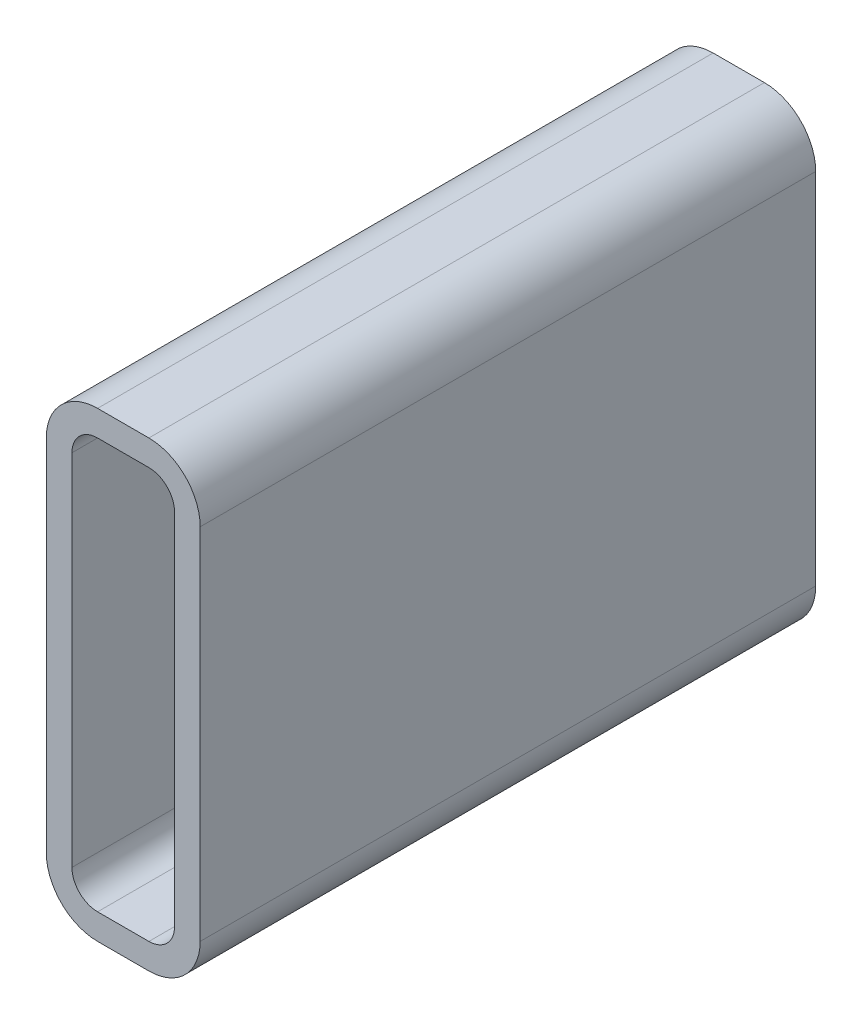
ISO-10303-21;
HEADER;
FILE_DESCRIPTION(('STEP AP214'),'2;1');
FILE_NAME('part.step','',(''),(''),'','','');
FILE_SCHEMA(('AUTOMOTIVE_DESIGN { 1 0 10303 214 1 1 1 1 }'));
ENDSEC;
DATA;
#1=APPLICATION_CONTEXT('core data for automotive mechanical design processes');
#2=APPLICATION_PROTOCOL_DEFINITION('international standard','automotive_design',2000,#1);
#3=PRODUCT_CONTEXT('',#1,'mechanical');
#4=PRODUCT('Part','Part','',(#3));
#5=PRODUCT_RELATED_PRODUCT_CATEGORY('part','',(#4));
#6=PRODUCT_DEFINITION_FORMATION('','',#4);
#7=PRODUCT_DEFINITION_CONTEXT('part definition',#1,'design');
#8=PRODUCT_DEFINITION('design','',#6,#7);
#9=PRODUCT_DEFINITION_SHAPE('','',#8);
#10=(LENGTH_UNIT() NAMED_UNIT(*) SI_UNIT(.MILLI.,.METRE.));
#11=(NAMED_UNIT(*) PLANE_ANGLE_UNIT() SI_UNIT($,.RADIAN.));
#12=(NAMED_UNIT(*) SI_UNIT($,.STERADIAN.) SOLID_ANGLE_UNIT());
#13=UNCERTAINTY_MEASURE_WITH_UNIT(LENGTH_MEASURE(1.E-05),#10,'distance_accuracy_value','');
#14=(GEOMETRIC_REPRESENTATION_CONTEXT(3) GLOBAL_UNCERTAINTY_ASSIGNED_CONTEXT((#13)) GLOBAL_UNIT_ASSIGNED_CONTEXT((#10,
#11,#12)) REPRESENTATION_CONTEXT('',''));
#15=CARTESIAN_POINT('',(0.,0.,0.));
#16=DIRECTION('',(0.,0.,1.));
#17=DIRECTION('',(1.,0.,0.));
#18=AXIS2_PLACEMENT_3D('',#15,#16,#17);
#19=CARTESIAN_POINT('',(27.8891160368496,205.143222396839,304.8));
#20=DIRECTION('',(0.,0.,1.));
#21=DIRECTION('',(1.,0.,0.));
#22=AXIS2_PLACEMENT_3D('',#19,#20,#21);
#23=PLANE('',#22);
#24=CARTESIAN_POINT('',(27.8891160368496,205.143222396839,304.8));
#25=DIRECTION('',(0.,0.,1.));
#26=DIRECTION('',(1.,0.,0.));
#27=AXIS2_PLACEMENT_3D('',#24,#25,#26);
#28=CIRCLE('',#27,25.4);
#29=CARTESIAN_POINT('',(27.8891160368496,230.543222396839,304.8));
#30=VERTEX_POINT('',#29);
#31=CARTESIAN_POINT('',(2.48911603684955,205.143222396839,304.8));
#32=VERTEX_POINT('',#31);
#33=EDGE_CURVE('E211',#30,#32,#28,.T.);
#34=ORIENTED_EDGE('',*,*,#33,.T.);
#35=DIRECTION('',(0.,-1.,0.));
#36=VECTOR('',#35,1.);
#37=CARTESIAN_POINT('',(2.48911603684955,27.3432223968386,304.8));
#38=LINE('',#37,#36);
#39=CARTESIAN_POINT('',(2.48911603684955,27.3432223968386,304.8));
#40=VERTEX_POINT('',#39);
#41=EDGE_CURVE('E214',#32,#40,#38,.T.);
#42=ORIENTED_EDGE('',*,*,#41,.T.);
#43=CARTESIAN_POINT('',(27.8891160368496,27.3432223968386,304.8));
#44=DIRECTION('',(0.,0.,1.));
#45=DIRECTION('',(1.,0.,0.));
#46=AXIS2_PLACEMENT_3D('',#43,#44,#45);
#47=CIRCLE('',#46,25.4);
#48=CARTESIAN_POINT('',(27.8891160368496,1.94322239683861,304.8));
#49=VERTEX_POINT('',#48);
#50=EDGE_CURVE('E217',#40,#49,#47,.T.);
#51=ORIENTED_EDGE('',*,*,#50,.T.);
#52=DIRECTION('',(1.,0.,0.));
#53=VECTOR('',#52,1.);
#54=CARTESIAN_POINT('',(53.2891160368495,1.94322239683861,304.8));
#55=LINE('',#54,#53);
#56=CARTESIAN_POINT('',(53.2891160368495,1.94322239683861,304.8));
#57=VERTEX_POINT('',#56);
#58=EDGE_CURVE('E219',#49,#57,#55,.T.);
#59=ORIENTED_EDGE('',*,*,#58,.T.);
#60=CARTESIAN_POINT('',(53.2891160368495,27.3432223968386,304.8));
#61=DIRECTION('',(0.,0.,1.));
#62=DIRECTION('',(1.,0.,0.));
#63=AXIS2_PLACEMENT_3D('',#60,#61,#62);
#64=CIRCLE('',#63,25.4);
#65=CARTESIAN_POINT('',(78.6891160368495,27.3432223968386,304.8));
#66=VERTEX_POINT('',#65);
#67=EDGE_CURVE('E221',#57,#66,#64,.T.);
#68=ORIENTED_EDGE('',*,*,#67,.T.);
#69=DIRECTION('',(0.,1.,0.));
#70=VECTOR('',#69,1.);
#71=CARTESIAN_POINT('',(78.6891160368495,205.143222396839,304.8));
#72=LINE('',#71,#70);
#73=CARTESIAN_POINT('',(78.6891160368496,205.143222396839,304.8));
#74=VERTEX_POINT('',#73);
#75=EDGE_CURVE('E223',#66,#74,#72,.T.);
#76=ORIENTED_EDGE('',*,*,#75,.T.);
#77=CARTESIAN_POINT('',(53.2891160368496,205.143222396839,304.8));
#78=DIRECTION('',(0.,0.,1.));
#79=DIRECTION('',(1.,0.,0.));
#80=AXIS2_PLACEMENT_3D('',#77,#78,#79);
#81=CIRCLE('',#80,25.4);
#82=CARTESIAN_POINT('',(53.2891160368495,230.543222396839,304.8));
#83=VERTEX_POINT('',#82);
#84=EDGE_CURVE('E225',#74,#83,#81,.T.);
#85=ORIENTED_EDGE('',*,*,#84,.T.);
#86=DIRECTION('',(-1.,0.,0.));
#87=VECTOR('',#86,1.);
#88=CARTESIAN_POINT('',(27.8891160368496,230.543222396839,304.8));
#89=LINE('',#88,#87);
#90=EDGE_CURVE('E227',#83,#30,#89,.T.);
#91=ORIENTED_EDGE('',*,*,#90,.T.);
#92=EDGE_LOOP('',(#34,#42,#51,#59,#68,#76,#85,#91));
#93=FACE_BOUND('',#92,.T.);
#94=DIRECTION('',(0.,-1.,0.));
#95=VECTOR('',#94,1.);
#96=CARTESIAN_POINT('',(15.1891160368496,27.3432223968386,304.8));
#97=LINE('',#96,#95);
#98=CARTESIAN_POINT('',(15.1891160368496,205.143222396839,304.8));
#99=VERTEX_POINT('',#98);
#100=CARTESIAN_POINT('',(15.1891160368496,27.3432223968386,304.8));
#101=VERTEX_POINT('',#100);
#102=EDGE_CURVE('E154',#99,#101,#97,.T.);
#103=ORIENTED_EDGE('',*,*,#102,.F.);
#104=CARTESIAN_POINT('',(27.8891160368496,205.143222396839,304.8));
#105=DIRECTION('',(0.,0.,1.));
#106=DIRECTION('',(1.,0.,0.));
#107=AXIS2_PLACEMENT_3D('',#104,#105,#106);
#108=CIRCLE('',#107,12.7);
#109=CARTESIAN_POINT('',(27.8891160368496,217.843222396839,304.8));
#110=VERTEX_POINT('',#109);
#111=EDGE_CURVE('E146',#110,#99,#108,.T.);
#112=ORIENTED_EDGE('',*,*,#111,.F.);
#113=DIRECTION('',(-1.,0.,0.));
#114=VECTOR('',#113,1.);
#115=CARTESIAN_POINT('',(27.8891160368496,217.843222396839,304.8));
#116=LINE('',#115,#114);
#117=CARTESIAN_POINT('',(53.2891160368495,217.843222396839,304.8));
#118=VERTEX_POINT('',#117);
#119=EDGE_CURVE('E179',#118,#110,#116,.T.);
#120=ORIENTED_EDGE('',*,*,#119,.F.);
#121=CARTESIAN_POINT('',(53.2891160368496,205.143222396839,304.8));
#122=DIRECTION('',(0.,0.,1.));
#123=DIRECTION('',(1.,0.,0.));
#124=AXIS2_PLACEMENT_3D('',#121,#122,#123);
#125=CIRCLE('',#124,12.7);
#126=CARTESIAN_POINT('',(65.9891160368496,205.143222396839,304.8));
#127=VERTEX_POINT('',#126);
#128=EDGE_CURVE('E177',#127,#118,#125,.T.);
#129=ORIENTED_EDGE('',*,*,#128,.F.);
#130=DIRECTION('',(0.,1.,0.));
#131=VECTOR('',#130,1.);
#132=CARTESIAN_POINT('',(65.9891160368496,205.143222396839,304.8));
#133=LINE('',#132,#131);
#134=CARTESIAN_POINT('',(65.9891160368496,27.3432223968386,304.8));
#135=VERTEX_POINT('',#134);
#136=EDGE_CURVE('E175',#135,#127,#133,.T.);
#137=ORIENTED_EDGE('',*,*,#136,.F.);
#138=CARTESIAN_POINT('',(53.2891160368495,27.3432223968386,304.8));
#139=DIRECTION('',(0.,0.,1.));
#140=DIRECTION('',(1.,0.,0.));
#141=AXIS2_PLACEMENT_3D('',#138,#139,#140);
#142=CIRCLE('',#141,12.7);
#143=CARTESIAN_POINT('',(53.2891160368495,14.6432223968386,304.8));
#144=VERTEX_POINT('',#143);
#145=EDGE_CURVE('E173',#144,#135,#142,.T.);
#146=ORIENTED_EDGE('',*,*,#145,.F.);
#147=DIRECTION('',(1.,0.,0.));
#148=VECTOR('',#147,1.);
#149=CARTESIAN_POINT('',(53.2891160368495,14.6432223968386,304.8));
#150=LINE('',#149,#148);
#151=CARTESIAN_POINT('',(27.8891160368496,14.6432223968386,304.8));
#152=VERTEX_POINT('',#151);
#153=EDGE_CURVE('E169',#152,#144,#150,.T.);
#154=ORIENTED_EDGE('',*,*,#153,.F.);
#155=CARTESIAN_POINT('',(27.8891160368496,27.3432223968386,304.8));
#156=DIRECTION('',(0.,0.,1.));
#157=DIRECTION('',(1.,0.,0.));
#158=AXIS2_PLACEMENT_3D('',#155,#156,#157);
#159=CIRCLE('',#158,12.7);
#160=EDGE_CURVE('E167',#101,#152,#159,.T.);
#161=ORIENTED_EDGE('',*,*,#160,.F.);
#162=EDGE_LOOP('',(#103,#112,#120,#129,#137,#146,#154,#161));
#163=FACE_BOUND('',#162,.T.);
#164=ADVANCED_FACE('F33',(#93,#163),#23,.T.);
#165=CARTESIAN_POINT('',(27.8891160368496,205.143222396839,0.));
#166=DIRECTION('',(0.,0.,1.));
#167=DIRECTION('',(1.,0.,0.));
#168=AXIS2_PLACEMENT_3D('',#165,#166,#167);
#169=PLANE('',#168);
#170=CARTESIAN_POINT('',(27.8891160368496,205.143222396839,0.));
#171=DIRECTION('',(0.,0.,1.));
#172=DIRECTION('',(1.,0.,0.));
#173=AXIS2_PLACEMENT_3D('',#170,#171,#172);
#174=CIRCLE('',#173,25.4);
#175=CARTESIAN_POINT('',(27.8891160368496,230.543222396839,0.));
#176=VERTEX_POINT('',#175);
#177=CARTESIAN_POINT('',(2.48911603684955,205.143222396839,0.));
#178=VERTEX_POINT('',#177);
#179=EDGE_CURVE('E162',#176,#178,#174,.T.);
#180=ORIENTED_EDGE('',*,*,#179,.F.);
#181=DIRECTION('',(-1.,0.,0.));
#182=VECTOR('',#181,1.);
#183=CARTESIAN_POINT('',(27.8891160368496,230.543222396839,0.));
#184=LINE('',#183,#182);
#185=CARTESIAN_POINT('',(53.2891160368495,230.543222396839,0.));
#186=VERTEX_POINT('',#185);
#187=EDGE_CURVE('E215',#186,#176,#184,.T.);
#188=ORIENTED_EDGE('',*,*,#187,.F.);
#189=CARTESIAN_POINT('',(53.2891160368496,205.143222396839,0.));
#190=DIRECTION('',(0.,0.,1.));
#191=DIRECTION('',(1.,0.,0.));
#192=AXIS2_PLACEMENT_3D('',#189,#190,#191);
#193=CIRCLE('',#192,25.4);
#194=CARTESIAN_POINT('',(78.6891160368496,205.143222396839,0.));
#195=VERTEX_POINT('',#194);
#196=EDGE_CURVE('E242',#195,#186,#193,.T.);
#197=ORIENTED_EDGE('',*,*,#196,.F.);
#198=DIRECTION('',(0.,1.,0.));
#199=VECTOR('',#198,1.);
#200=CARTESIAN_POINT('',(78.6891160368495,205.143222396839,0.));
#201=LINE('',#200,#199);
#202=CARTESIAN_POINT('',(78.6891160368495,27.3432223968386,0.));
#203=VERTEX_POINT('',#202);
#204=EDGE_CURVE('E240',#203,#195,#201,.T.);
#205=ORIENTED_EDGE('',*,*,#204,.F.);
#206=CARTESIAN_POINT('',(53.2891160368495,27.3432223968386,0.));
#207=DIRECTION('',(0.,0.,1.));
#208=DIRECTION('',(1.,0.,0.));
#209=AXIS2_PLACEMENT_3D('',#206,#207,#208);
#210=CIRCLE('',#209,25.4);
#211=CARTESIAN_POINT('',(53.2891160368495,1.94322239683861,0.));
#212=VERTEX_POINT('',#211);
#213=EDGE_CURVE('E238',#212,#203,#210,.T.);
#214=ORIENTED_EDGE('',*,*,#213,.F.);
#215=DIRECTION('',(1.,0.,0.));
#216=VECTOR('',#215,1.);
#217=CARTESIAN_POINT('',(53.2891160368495,1.94322239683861,0.));
#218=LINE('',#217,#216);
#219=CARTESIAN_POINT('',(27.8891160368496,1.94322239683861,0.));
#220=VERTEX_POINT('',#219);
#221=EDGE_CURVE('E236',#220,#212,#218,.T.);
#222=ORIENTED_EDGE('',*,*,#221,.F.);
#223=CARTESIAN_POINT('',(27.8891160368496,27.3432223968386,0.));
#224=DIRECTION('',(0.,0.,1.));
#225=DIRECTION('',(1.,0.,0.));
#226=AXIS2_PLACEMENT_3D('',#223,#224,#225);
#227=CIRCLE('',#226,25.4);
#228=CARTESIAN_POINT('',(2.48911603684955,27.3432223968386,0.));
#229=VERTEX_POINT('',#228);
#230=EDGE_CURVE('E234',#229,#220,#227,.T.);
#231=ORIENTED_EDGE('',*,*,#230,.F.);
#232=DIRECTION('',(0.,-1.,0.));
#233=VECTOR('',#232,1.);
#234=CARTESIAN_POINT('',(2.48911603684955,27.3432223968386,0.));
#235=LINE('',#234,#233);
#236=EDGE_CURVE('E232',#178,#229,#235,.T.);
#237=ORIENTED_EDGE('',*,*,#236,.F.);
#238=EDGE_LOOP('',(#180,#188,#197,#205,#214,#222,#231,#237));
#239=FACE_BOUND('',#238,.T.);
#240=CARTESIAN_POINT('',(27.8891160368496,205.143222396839,0.));
#241=DIRECTION('',(0.,0.,1.));
#242=DIRECTION('',(1.,0.,0.));
#243=AXIS2_PLACEMENT_3D('',#240,#241,#242);
#244=CIRCLE('',#243,12.7);
#245=CARTESIAN_POINT('',(27.8891160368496,217.843222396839,0.));
#246=VERTEX_POINT('',#245);
#247=CARTESIAN_POINT('',(15.1891160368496,205.143222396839,0.));
#248=VERTEX_POINT('',#247);
#249=EDGE_CURVE('E56',#246,#248,#244,.T.);
#250=ORIENTED_EDGE('',*,*,#249,.T.);
#251=DIRECTION('',(0.,-1.,0.));
#252=VECTOR('',#251,1.);
#253=CARTESIAN_POINT('',(15.1891160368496,27.3432223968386,0.));
#254=LINE('',#253,#252);
#255=CARTESIAN_POINT('',(15.1891160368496,27.3432223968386,0.));
#256=VERTEX_POINT('',#255);
#257=EDGE_CURVE('E161',#248,#256,#254,.T.);
#258=ORIENTED_EDGE('',*,*,#257,.T.);
#259=CARTESIAN_POINT('',(27.8891160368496,27.3432223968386,0.));
#260=DIRECTION('',(0.,0.,1.));
#261=DIRECTION('',(1.,0.,0.));
#262=AXIS2_PLACEMENT_3D('',#259,#260,#261);
#263=CIRCLE('',#262,12.7);
#264=CARTESIAN_POINT('',(27.8891160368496,14.6432223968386,0.));
#265=VERTEX_POINT('',#264);
#266=EDGE_CURVE('E183',#256,#265,#263,.T.);
#267=ORIENTED_EDGE('',*,*,#266,.T.);
#268=DIRECTION('',(1.,0.,0.));
#269=VECTOR('',#268,1.);
#270=CARTESIAN_POINT('',(53.2891160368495,14.6432223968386,0.));
#271=LINE('',#270,#269);
#272=CARTESIAN_POINT('',(53.2891160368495,14.6432223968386,0.));
#273=VERTEX_POINT('',#272);
#274=EDGE_CURVE('E186',#265,#273,#271,.T.);
#275=ORIENTED_EDGE('',*,*,#274,.T.);
#276=CARTESIAN_POINT('',(53.2891160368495,27.3432223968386,0.));
#277=DIRECTION('',(0.,0.,1.));
#278=DIRECTION('',(1.,0.,0.));
#279=AXIS2_PLACEMENT_3D('',#276,#277,#278);
#280=CIRCLE('',#279,12.7);
#281=CARTESIAN_POINT('',(65.9891160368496,27.3432223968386,0.));
#282=VERTEX_POINT('',#281);
#283=EDGE_CURVE('E189',#273,#282,#280,.T.);
#284=ORIENTED_EDGE('',*,*,#283,.T.);
#285=DIRECTION('',(0.,1.,0.));
#286=VECTOR('',#285,1.);
#287=CARTESIAN_POINT('',(65.9891160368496,205.143222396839,0.));
#288=LINE('',#287,#286);
#289=CARTESIAN_POINT('',(65.9891160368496,205.143222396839,0.));
#290=VERTEX_POINT('',#289);
#291=EDGE_CURVE('E192',#282,#290,#288,.T.);
#292=ORIENTED_EDGE('',*,*,#291,.T.);
#293=CARTESIAN_POINT('',(53.2891160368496,205.143222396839,0.));
#294=DIRECTION('',(0.,0.,1.));
#295=DIRECTION('',(1.,0.,0.));
#296=AXIS2_PLACEMENT_3D('',#293,#294,#295);
#297=CIRCLE('',#296,12.7);
#298=CARTESIAN_POINT('',(53.2891160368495,217.843222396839,0.));
#299=VERTEX_POINT('',#298);
#300=EDGE_CURVE('E195',#290,#299,#297,.T.);
#301=ORIENTED_EDGE('',*,*,#300,.T.);
#302=DIRECTION('',(-1.,0.,0.));
#303=VECTOR('',#302,1.);
#304=CARTESIAN_POINT('',(27.8891160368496,217.843222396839,0.));
#305=LINE('',#304,#303);
#306=EDGE_CURVE('E155',#299,#246,#305,.T.);
#307=ORIENTED_EDGE('',*,*,#306,.T.);
#308=EDGE_LOOP('',(#250,#258,#267,#275,#284,#292,#301,#307));
#309=FACE_BOUND('',#308,.T.);
#310=ADVANCED_FACE('F272',(#239,#309),#169,.F.);
#311=CARTESIAN_POINT('',(27.8891160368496,205.143222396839,304.8));
#312=DIRECTION('',(0.,0.,-1.));
#313=DIRECTION('',(-1.,0.,0.));
#314=AXIS2_PLACEMENT_3D('',#311,#312,#313);
#315=CYLINDRICAL_SURFACE('',#314,25.4);
#316=ORIENTED_EDGE('',*,*,#179,.T.);
#317=DIRECTION('',(0.,0.,-1.));
#318=VECTOR('',#317,1.);
#319=CARTESIAN_POINT('',(2.48911603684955,205.143222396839,304.8));
#320=LINE('',#319,#318);
#321=EDGE_CURVE('E11',#32,#178,#320,.T.);
#322=ORIENTED_EDGE('',*,*,#321,.F.);
#323=ORIENTED_EDGE('',*,*,#33,.F.);
#324=DIRECTION('',(0.,0.,-1.));
#325=VECTOR('',#324,1.);
#326=CARTESIAN_POINT('',(27.8891160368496,230.543222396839,304.8));
#327=LINE('',#326,#325);
#328=EDGE_CURVE('E229',#30,#176,#327,.T.);
#329=ORIENTED_EDGE('',*,*,#328,.T.);
#330=EDGE_LOOP('',(#316,#322,#323,#329));
#331=FACE_BOUND('',#330,.T.);
#332=ADVANCED_FACE('F35',(#331),#315,.T.);
#333=CARTESIAN_POINT('',(2.48911603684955,27.3432223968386,304.8));
#334=DIRECTION('',(1.,0.,0.));
#335=DIRECTION('',(0.,0.,-1.));
#336=AXIS2_PLACEMENT_3D('',#333,#334,#335);
#337=PLANE('',#336);
#338=ORIENTED_EDGE('',*,*,#236,.T.);
#339=DIRECTION('',(0.,0.,-1.));
#340=VECTOR('',#339,1.);
#341=CARTESIAN_POINT('',(2.48911603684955,27.3432223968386,304.8));
#342=LINE('',#341,#340);
#343=EDGE_CURVE('E41',#40,#229,#342,.T.);
#344=ORIENTED_EDGE('',*,*,#343,.F.);
#345=ORIENTED_EDGE('',*,*,#41,.F.);
#346=ORIENTED_EDGE('',*,*,#321,.T.);
#347=EDGE_LOOP('',(#338,#344,#345,#346));
#348=FACE_BOUND('',#347,.T.);
#349=ADVANCED_FACE('F289',(#348),#337,.F.);
#350=CARTESIAN_POINT('',(27.8891160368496,27.3432223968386,304.8));
#351=DIRECTION('',(0.,0.,-1.));
#352=DIRECTION('',(-1.,0.,0.));
#353=AXIS2_PLACEMENT_3D('',#350,#351,#352);
#354=CYLINDRICAL_SURFACE('',#353,25.4);
#355=ORIENTED_EDGE('',*,*,#230,.T.);
#356=DIRECTION('',(0.,0.,-1.));
#357=VECTOR('',#356,1.);
#358=CARTESIAN_POINT('',(27.8891160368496,1.94322239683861,304.8));
#359=LINE('',#358,#357);
#360=EDGE_CURVE('E259',#49,#220,#359,.T.);
#361=ORIENTED_EDGE('',*,*,#360,.F.);
#362=ORIENTED_EDGE('',*,*,#50,.F.);
#363=ORIENTED_EDGE('',*,*,#343,.T.);
#364=EDGE_LOOP('',(#355,#361,#362,#363));
#365=FACE_BOUND('',#364,.T.);
#366=ADVANCED_FACE('F266',(#365),#354,.T.);
#367=CARTESIAN_POINT('',(53.2891160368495,1.94322239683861,304.8));
#368=DIRECTION('',(0.,1.,0.));
#369=DIRECTION('',(0.,0.,1.));
#370=AXIS2_PLACEMENT_3D('',#367,#368,#369);
#371=PLANE('',#370);
#372=ORIENTED_EDGE('',*,*,#221,.T.);
#373=DIRECTION('',(0.,0.,-1.));
#374=VECTOR('',#373,1.);
#375=CARTESIAN_POINT('',(53.2891160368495,1.94322239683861,304.8));
#376=LINE('',#375,#374);
#377=EDGE_CURVE('E256',#57,#212,#376,.T.);
#378=ORIENTED_EDGE('',*,*,#377,.F.);
#379=ORIENTED_EDGE('',*,*,#58,.F.);
#380=ORIENTED_EDGE('',*,*,#360,.T.);
#381=EDGE_LOOP('',(#372,#378,#379,#380));
#382=FACE_BOUND('',#381,.T.);
#383=ADVANCED_FACE('F278',(#382),#371,.F.);
#384=CARTESIAN_POINT('',(53.2891160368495,27.3432223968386,304.8));
#385=DIRECTION('',(0.,0.,-1.));
#386=DIRECTION('',(-1.,0.,0.));
#387=AXIS2_PLACEMENT_3D('',#384,#385,#386);
#388=CYLINDRICAL_SURFACE('',#387,25.4);
#389=ORIENTED_EDGE('',*,*,#213,.T.);
#390=DIRECTION('',(0.,0.,-1.));
#391=VECTOR('',#390,1.);
#392=CARTESIAN_POINT('',(78.6891160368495,27.3432223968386,304.8));
#393=LINE('',#392,#391);
#394=EDGE_CURVE('E253',#66,#203,#393,.T.);
#395=ORIENTED_EDGE('',*,*,#394,.F.);
#396=ORIENTED_EDGE('',*,*,#67,.F.);
#397=ORIENTED_EDGE('',*,*,#377,.T.);
#398=EDGE_LOOP('',(#389,#395,#396,#397));
#399=FACE_BOUND('',#398,.T.);
#400=ADVANCED_FACE('F282',(#399),#388,.T.);
#401=CARTESIAN_POINT('',(78.6891160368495,205.143222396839,304.8));
#402=DIRECTION('',(-1.,0.,0.));
#403=DIRECTION('',(0.,0.,1.));
#404=AXIS2_PLACEMENT_3D('',#401,#402,#403);
#405=PLANE('',#404);
#406=ORIENTED_EDGE('',*,*,#204,.T.);
#407=DIRECTION('',(0.,0.,-1.));
#408=VECTOR('',#407,1.);
#409=CARTESIAN_POINT('',(78.6891160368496,205.143222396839,304.8));
#410=LINE('',#409,#408);
#411=EDGE_CURVE('E250',#74,#195,#410,.T.);
#412=ORIENTED_EDGE('',*,*,#411,.F.);
#413=ORIENTED_EDGE('',*,*,#75,.F.);
#414=ORIENTED_EDGE('',*,*,#394,.T.);
#415=EDGE_LOOP('',(#406,#412,#413,#414));
#416=FACE_BOUND('',#415,.T.);
#417=ADVANCED_FACE('F302',(#416),#405,.F.);
#418=CARTESIAN_POINT('',(53.2891160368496,205.143222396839,304.8));
#419=DIRECTION('',(0.,0.,-1.));
#420=DIRECTION('',(-1.,0.,0.));
#421=AXIS2_PLACEMENT_3D('',#418,#419,#420);
#422=CYLINDRICAL_SURFACE('',#421,25.4);
#423=ORIENTED_EDGE('',*,*,#196,.T.);
#424=DIRECTION('',(0.,0.,-1.));
#425=VECTOR('',#424,1.);
#426=CARTESIAN_POINT('',(53.2891160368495,230.543222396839,304.8));
#427=LINE('',#426,#425);
#428=EDGE_CURVE('E247',#83,#186,#427,.T.);
#429=ORIENTED_EDGE('',*,*,#428,.F.);
#430=ORIENTED_EDGE('',*,*,#84,.F.);
#431=ORIENTED_EDGE('',*,*,#411,.T.);
#432=EDGE_LOOP('',(#423,#429,#430,#431));
#433=FACE_BOUND('',#432,.T.);
#434=ADVANCED_FACE('F300',(#433),#422,.T.);
#435=CARTESIAN_POINT('',(27.8891160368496,230.543222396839,304.8));
#436=DIRECTION('',(0.,-1.,0.));
#437=DIRECTION('',(0.,0.,-1.));
#438=AXIS2_PLACEMENT_3D('',#435,#436,#437);
#439=PLANE('',#438);
#440=ORIENTED_EDGE('',*,*,#187,.T.);
#441=ORIENTED_EDGE('',*,*,#328,.F.);
#442=ORIENTED_EDGE('',*,*,#90,.F.);
#443=ORIENTED_EDGE('',*,*,#428,.T.);
#444=EDGE_LOOP('',(#440,#441,#442,#443));
#445=FACE_BOUND('',#444,.T.);
#446=ADVANCED_FACE('F295',(#445),#439,.F.);
#447=CARTESIAN_POINT('',(27.8891160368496,205.143222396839,304.8));
#448=DIRECTION('',(0.,0.,-1.));
#449=DIRECTION('',(-1.,0.,0.));
#450=AXIS2_PLACEMENT_3D('',#447,#448,#449);
#451=CYLINDRICAL_SURFACE('',#450,12.7);
#452=ORIENTED_EDGE('',*,*,#249,.F.);
#453=DIRECTION('',(0.,0.,-1.));
#454=VECTOR('',#453,1.);
#455=CARTESIAN_POINT('',(27.8891160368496,217.843222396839,304.8));
#456=LINE('',#455,#454);
#457=EDGE_CURVE('E150',#110,#246,#456,.T.);
#458=ORIENTED_EDGE('',*,*,#457,.F.);
#459=ORIENTED_EDGE('',*,*,#111,.T.);
#460=DIRECTION('',(0.,0.,-1.));
#461=VECTOR('',#460,1.);
#462=CARTESIAN_POINT('',(15.1891160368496,205.143222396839,304.8));
#463=LINE('',#462,#461);
#464=EDGE_CURVE('E149',#99,#248,#463,.T.);
#465=ORIENTED_EDGE('',*,*,#464,.T.);
#466=EDGE_LOOP('',(#452,#458,#459,#465));
#467=FACE_BOUND('',#466,.T.);
#468=ADVANCED_FACE('F148',(#467),#451,.F.);
#469=CARTESIAN_POINT('',(15.1891160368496,27.3432223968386,304.8));
#470=DIRECTION('',(1.,0.,0.));
#471=DIRECTION('',(0.,0.,-1.));
#472=AXIS2_PLACEMENT_3D('',#469,#470,#471);
#473=PLANE('',#472);
#474=ORIENTED_EDGE('',*,*,#257,.F.);
#475=ORIENTED_EDGE('',*,*,#464,.F.);
#476=ORIENTED_EDGE('',*,*,#102,.T.);
#477=DIRECTION('',(0.,0.,-1.));
#478=VECTOR('',#477,1.);
#479=CARTESIAN_POINT('',(15.1891160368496,27.3432223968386,304.8));
#480=LINE('',#479,#478);
#481=EDGE_CURVE('E163',#101,#256,#480,.T.);
#482=ORIENTED_EDGE('',*,*,#481,.T.);
#483=EDGE_LOOP('',(#474,#475,#476,#482));
#484=FACE_BOUND('',#483,.T.);
#485=ADVANCED_FACE('F158',(#484),#473,.T.);
#486=CARTESIAN_POINT('',(27.8891160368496,27.3432223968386,304.8));
#487=DIRECTION('',(0.,0.,-1.));
#488=DIRECTION('',(-1.,0.,0.));
#489=AXIS2_PLACEMENT_3D('',#486,#487,#488);
#490=CYLINDRICAL_SURFACE('',#489,12.7);
#491=ORIENTED_EDGE('',*,*,#266,.F.);
#492=ORIENTED_EDGE('',*,*,#481,.F.);
#493=ORIENTED_EDGE('',*,*,#160,.T.);
#494=DIRECTION('',(0.,0.,-1.));
#495=VECTOR('',#494,1.);
#496=CARTESIAN_POINT('',(27.8891160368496,14.6432223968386,304.8));
#497=LINE('',#496,#495);
#498=EDGE_CURVE('E208',#152,#265,#497,.T.);
#499=ORIENTED_EDGE('',*,*,#498,.T.);
#500=EDGE_LOOP('',(#491,#492,#493,#499));
#501=FACE_BOUND('',#500,.T.);
#502=ADVANCED_FACE('F327',(#501),#490,.F.);
#503=CARTESIAN_POINT('',(53.2891160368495,14.6432223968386,304.8));
#504=DIRECTION('',(0.,1.,0.));
#505=DIRECTION('',(0.,0.,1.));
#506=AXIS2_PLACEMENT_3D('',#503,#504,#505);
#507=PLANE('',#506);
#508=ORIENTED_EDGE('',*,*,#274,.F.);
#509=ORIENTED_EDGE('',*,*,#498,.F.);
#510=ORIENTED_EDGE('',*,*,#153,.T.);
#511=DIRECTION('',(0.,0.,-1.));
#512=VECTOR('',#511,1.);
#513=CARTESIAN_POINT('',(53.2891160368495,14.6432223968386,304.8));
#514=LINE('',#513,#512);
#515=EDGE_CURVE('E206',#144,#273,#514,.T.);
#516=ORIENTED_EDGE('',*,*,#515,.T.);
#517=EDGE_LOOP('',(#508,#509,#510,#516));
#518=FACE_BOUND('',#517,.T.);
#519=ADVANCED_FACE('F331',(#518),#507,.T.);
#520=CARTESIAN_POINT('',(53.2891160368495,27.3432223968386,304.8));
#521=DIRECTION('',(0.,0.,-1.));
#522=DIRECTION('',(-1.,0.,0.));
#523=AXIS2_PLACEMENT_3D('',#520,#521,#522);
#524=CYLINDRICAL_SURFACE('',#523,12.7);
#525=ORIENTED_EDGE('',*,*,#283,.F.);
#526=ORIENTED_EDGE('',*,*,#515,.F.);
#527=ORIENTED_EDGE('',*,*,#145,.T.);
#528=DIRECTION('',(0.,0.,-1.));
#529=VECTOR('',#528,1.);
#530=CARTESIAN_POINT('',(65.9891160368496,27.3432223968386,304.8));
#531=LINE('',#530,#529);
#532=EDGE_CURVE('E204',#135,#282,#531,.T.);
#533=ORIENTED_EDGE('',*,*,#532,.T.);
#534=EDGE_LOOP('',(#525,#526,#527,#533));
#535=FACE_BOUND('',#534,.T.);
#536=ADVANCED_FACE('F337',(#535),#524,.F.);
#537=CARTESIAN_POINT('',(65.9891160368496,205.143222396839,304.8));
#538=DIRECTION('',(-1.,0.,0.));
#539=DIRECTION('',(0.,0.,1.));
#540=AXIS2_PLACEMENT_3D('',#537,#538,#539);
#541=PLANE('',#540);
#542=ORIENTED_EDGE('',*,*,#291,.F.);
#543=ORIENTED_EDGE('',*,*,#532,.F.);
#544=ORIENTED_EDGE('',*,*,#136,.T.);
#545=DIRECTION('',(0.,0.,-1.));
#546=VECTOR('',#545,1.);
#547=CARTESIAN_POINT('',(65.9891160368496,205.143222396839,304.8));
#548=LINE('',#547,#546);
#549=EDGE_CURVE('E202',#127,#290,#548,.T.);
#550=ORIENTED_EDGE('',*,*,#549,.T.);
#551=EDGE_LOOP('',(#542,#543,#544,#550));
#552=FACE_BOUND('',#551,.T.);
#553=ADVANCED_FACE('F341',(#552),#541,.T.);
#554=CARTESIAN_POINT('',(53.2891160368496,205.143222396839,304.8));
#555=DIRECTION('',(0.,0.,-1.));
#556=DIRECTION('',(-1.,0.,0.));
#557=AXIS2_PLACEMENT_3D('',#554,#555,#556);
#558=CYLINDRICAL_SURFACE('',#557,12.7);
#559=ORIENTED_EDGE('',*,*,#300,.F.);
#560=ORIENTED_EDGE('',*,*,#549,.F.);
#561=ORIENTED_EDGE('',*,*,#128,.T.);
#562=DIRECTION('',(0.,0.,-1.));
#563=VECTOR('',#562,1.);
#564=CARTESIAN_POINT('',(53.2891160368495,217.843222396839,304.8));
#565=LINE('',#564,#563);
#566=EDGE_CURVE('E48',#118,#299,#565,.T.);
#567=ORIENTED_EDGE('',*,*,#566,.T.);
#568=EDGE_LOOP('',(#559,#560,#561,#567));
#569=FACE_BOUND('',#568,.T.);
#570=ADVANCED_FACE('F345',(#569),#558,.F.);
#571=CARTESIAN_POINT('',(27.8891160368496,217.843222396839,304.8));
#572=DIRECTION('',(0.,-1.,0.));
#573=DIRECTION('',(0.,0.,-1.));
#574=AXIS2_PLACEMENT_3D('',#571,#572,#573);
#575=PLANE('',#574);
#576=ORIENTED_EDGE('',*,*,#306,.F.);
#577=ORIENTED_EDGE('',*,*,#566,.F.);
#578=ORIENTED_EDGE('',*,*,#119,.T.);
#579=ORIENTED_EDGE('',*,*,#457,.T.);
#580=EDGE_LOOP('',(#576,#577,#578,#579));
#581=FACE_BOUND('',#580,.T.);
#582=ADVANCED_FACE('F349',(#581),#575,.T.);
#583=CLOSED_SHELL('',(#164,#310,#332,#349,#366,#383,#400,#417,#434,#446,#468,#485,#502,#519,
#536,#553,#570,#582));
#584=MANIFOLD_SOLID_BREP('B2',#583);
#585=ADVANCED_BREP_SHAPE_REPRESENTATION('',(#18,#584),#14);
#586=SHAPE_DEFINITION_REPRESENTATION(#9,#585);
ENDSEC;
END-ISO-10303-21;
